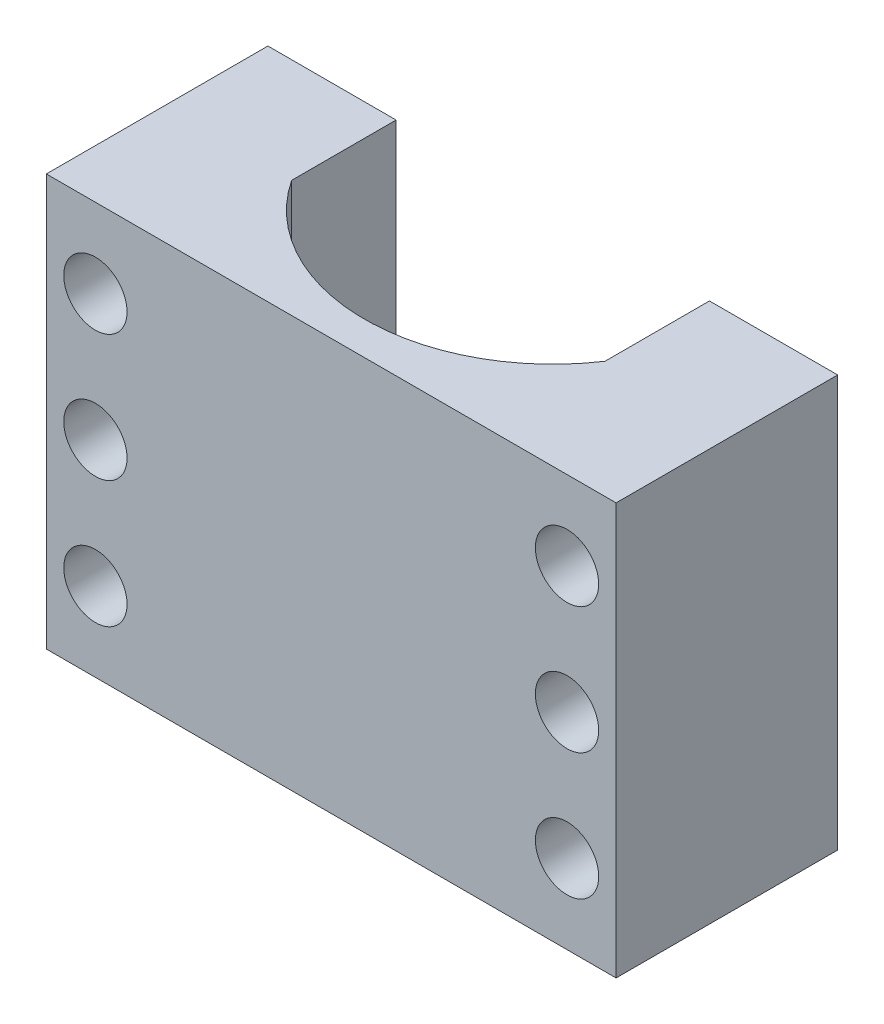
ISO-10303-21;
HEADER;
FILE_DESCRIPTION(('STEP AP214'),'2;1');
FILE_NAME('part.step','',(''),(''),'','','');
FILE_SCHEMA(('AUTOMOTIVE_DESIGN { 1 0 10303 214 1 1 1 1 }'));
ENDSEC;
DATA;
#1=APPLICATION_CONTEXT('core data for automotive mechanical design processes');
#2=APPLICATION_PROTOCOL_DEFINITION('international standard','automotive_design',2000,#1);
#3=PRODUCT_CONTEXT('',#1,'mechanical');
#4=PRODUCT('Part','Part','',(#3));
#5=PRODUCT_RELATED_PRODUCT_CATEGORY('part','',(#4));
#6=PRODUCT_DEFINITION_FORMATION('','',#4);
#7=PRODUCT_DEFINITION_CONTEXT('part definition',#1,'design');
#8=PRODUCT_DEFINITION('design','',#6,#7);
#9=PRODUCT_DEFINITION_SHAPE('','',#8);
#10=(LENGTH_UNIT() NAMED_UNIT(*) SI_UNIT(.MILLI.,.METRE.));
#11=(NAMED_UNIT(*) PLANE_ANGLE_UNIT() SI_UNIT($,.RADIAN.));
#12=(NAMED_UNIT(*) SI_UNIT($,.STERADIAN.) SOLID_ANGLE_UNIT());
#13=UNCERTAINTY_MEASURE_WITH_UNIT(LENGTH_MEASURE(1.E-05),#10,'distance_accuracy_value','');
#14=(GEOMETRIC_REPRESENTATION_CONTEXT(3) GLOBAL_UNCERTAINTY_ASSIGNED_CONTEXT((#13)) GLOBAL_UNIT_ASSIGNED_CONTEXT((#10,
#11,#12)) REPRESENTATION_CONTEXT('',''));
#15=CARTESIAN_POINT('',(0.,0.,0.));
#16=DIRECTION('',(0.,0.,1.));
#17=DIRECTION('',(1.,0.,0.));
#18=AXIS2_PLACEMENT_3D('',#15,#16,#17);
#19=CARTESIAN_POINT('',(0.,-6.5,14.));
#20=DIRECTION('',(0.,1.,0.));
#21=DIRECTION('',(0.,0.,1.));
#22=AXIS2_PLACEMENT_3D('',#19,#20,#21);
#23=PLANE('',#22);
#24=DIRECTION('',(0.,0.,-1.));
#25=VECTOR('',#24,1.);
#26=CARTESIAN_POINT('',(-9.,-6.5,14.));
#27=LINE('',#26,#25);
#28=CARTESIAN_POINT('',(-9.,-6.5,14.));
#29=VERTEX_POINT('',#28);
#30=CARTESIAN_POINT('',(-9.,-6.5,7.));
#31=VERTEX_POINT('',#30);
#32=EDGE_CURVE('E131',#29,#31,#27,.T.);
#33=ORIENTED_EDGE('',*,*,#32,.T.);
#34=DIRECTION('',(-1.,0.,0.));
#35=VECTOR('',#34,1.);
#36=CARTESIAN_POINT('',(9.,-6.5,7.));
#37=LINE('',#36,#35);
#38=CARTESIAN_POINT('',(-4.95,-6.5,7.));
#39=VERTEX_POINT('',#38);
#40=EDGE_CURVE('E107',#39,#31,#37,.T.);
#41=ORIENTED_EDGE('',*,*,#40,.F.);
#42=DIRECTION('',(0.,0.,-1.));
#43=VECTOR('',#42,1.);
#44=CARTESIAN_POINT('',(-4.95,-6.5,0.));
#45=LINE('',#44,#43);
#46=CARTESIAN_POINT('',(-4.95,-6.5,10.3015148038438));
#47=VERTEX_POINT('',#46);
#48=EDGE_CURVE('E186',#47,#39,#45,.T.);
#49=ORIENTED_EDGE('',*,*,#48,.F.);
#50=CARTESIAN_POINT('',(0.,-6.5,7.));
#51=DIRECTION('',(0.,1.,0.));
#52=DIRECTION('',(0.,0.,1.));
#53=AXIS2_PLACEMENT_3D('',#50,#51,#52);
#54=CIRCLE('',#53,5.95);
#55=CARTESIAN_POINT('',(4.95,-6.5,10.3015148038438));
#56=VERTEX_POINT('',#55);
#57=EDGE_CURVE('E190',#47,#56,#54,.T.);
#58=ORIENTED_EDGE('',*,*,#57,.T.);
#59=DIRECTION('',(0.,0.,-1.));
#60=VECTOR('',#59,1.);
#61=CARTESIAN_POINT('',(4.95,-6.5,0.));
#62=LINE('',#61,#60);
#63=CARTESIAN_POINT('',(4.95,-6.5,7.));
#64=VERTEX_POINT('',#63);
#65=EDGE_CURVE('E153',#56,#64,#62,.T.);
#66=ORIENTED_EDGE('',*,*,#65,.T.);
#67=CARTESIAN_POINT('',(9.,-6.5,7.));
#68=VERTEX_POINT('',#67);
#69=EDGE_CURVE('E64',#68,#64,#37,.T.);
#70=ORIENTED_EDGE('',*,*,#69,.F.);
#71=DIRECTION('',(0.,0.,-1.));
#72=VECTOR('',#71,1.);
#73=CARTESIAN_POINT('',(9.,-6.5,14.));
#74=LINE('',#73,#72);
#75=CARTESIAN_POINT('',(9.,-6.5,14.));
#76=VERTEX_POINT('',#75);
#77=EDGE_CURVE('E49',#76,#68,#74,.T.);
#78=ORIENTED_EDGE('',*,*,#77,.F.);
#79=DIRECTION('',(1.,0.,0.));
#80=VECTOR('',#79,1.);
#81=CARTESIAN_POINT('',(0.,-6.5,14.));
#82=LINE('',#81,#80);
#83=EDGE_CURVE('E150',#29,#76,#82,.T.);
#84=ORIENTED_EDGE('',*,*,#83,.F.);
#85=EDGE_LOOP('',(#33,#41,#49,#58,#66,#70,#78,#84));
#86=FACE_BOUND('',#85,.T.);
#87=ADVANCED_FACE('F41',(#86),#23,.F.);
#88=CARTESIAN_POINT('',(0.,6.5,14.));
#89=DIRECTION('',(0.,1.,0.));
#90=DIRECTION('',(0.,0.,1.));
#91=AXIS2_PLACEMENT_3D('',#88,#89,#90);
#92=PLANE('',#91);
#93=DIRECTION('',(1.,0.,0.));
#94=VECTOR('',#93,1.);
#95=CARTESIAN_POINT('',(9.,6.5,7.));
#96=LINE('',#95,#94);
#97=CARTESIAN_POINT('',(-9.,6.5,7.));
#98=VERTEX_POINT('',#97);
#99=CARTESIAN_POINT('',(-4.95,6.5,7.));
#100=VERTEX_POINT('',#99);
#101=EDGE_CURVE('E56',#98,#100,#96,.T.);
#102=ORIENTED_EDGE('',*,*,#101,.F.);
#103=DIRECTION('',(0.,0.,-1.));
#104=VECTOR('',#103,1.);
#105=CARTESIAN_POINT('',(-9.,6.5,14.));
#106=LINE('',#105,#104);
#107=CARTESIAN_POINT('',(-9.,6.5,14.));
#108=VERTEX_POINT('',#107);
#109=EDGE_CURVE('E118',#108,#98,#106,.T.);
#110=ORIENTED_EDGE('',*,*,#109,.F.);
#111=DIRECTION('',(1.,0.,0.));
#112=VECTOR('',#111,1.);
#113=CARTESIAN_POINT('',(0.,6.5,14.));
#114=LINE('',#113,#112);
#115=CARTESIAN_POINT('',(9.,6.5,14.));
#116=VERTEX_POINT('',#115);
#117=EDGE_CURVE('E240',#108,#116,#114,.T.);
#118=ORIENTED_EDGE('',*,*,#117,.T.);
#119=DIRECTION('',(0.,0.,-1.));
#120=VECTOR('',#119,1.);
#121=CARTESIAN_POINT('',(9.,6.5,14.));
#122=LINE('',#121,#120);
#123=CARTESIAN_POINT('',(9.,6.5,7.));
#124=VERTEX_POINT('',#123);
#125=EDGE_CURVE('E130',#116,#124,#122,.T.);
#126=ORIENTED_EDGE('',*,*,#125,.T.);
#127=CARTESIAN_POINT('',(4.95,6.5,7.));
#128=VERTEX_POINT('',#127);
#129=EDGE_CURVE('E112',#128,#124,#96,.T.);
#130=ORIENTED_EDGE('',*,*,#129,.F.);
#131=DIRECTION('',(0.,0.,-1.));
#132=VECTOR('',#131,1.);
#133=CARTESIAN_POINT('',(4.95,6.5,0.));
#134=LINE('',#133,#132);
#135=CARTESIAN_POINT('',(4.95,6.5,10.3015148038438));
#136=VERTEX_POINT('',#135);
#137=EDGE_CURVE('E191',#136,#128,#134,.T.);
#138=ORIENTED_EDGE('',*,*,#137,.F.);
#139=CARTESIAN_POINT('',(0.,6.5,7.));
#140=DIRECTION('',(0.,1.,0.));
#141=DIRECTION('',(0.,0.,1.));
#142=AXIS2_PLACEMENT_3D('',#139,#140,#141);
#143=CIRCLE('',#142,5.95);
#144=CARTESIAN_POINT('',(-4.95,6.5,10.3015148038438));
#145=VERTEX_POINT('',#144);
#146=EDGE_CURVE('E199',#145,#136,#143,.T.);
#147=ORIENTED_EDGE('',*,*,#146,.F.);
#148=DIRECTION('',(0.,0.,-1.));
#149=VECTOR('',#148,1.);
#150=CARTESIAN_POINT('',(-4.95,6.5,0.));
#151=LINE('',#150,#149);
#152=EDGE_CURVE('E121',#145,#100,#151,.T.);
#153=ORIENTED_EDGE('',*,*,#152,.T.);
#154=EDGE_LOOP('',(#102,#110,#118,#126,#130,#138,#147,#153));
#155=FACE_BOUND('',#154,.T.);
#156=ADVANCED_FACE('F116',(#155),#92,.T.);
#157=CARTESIAN_POINT('',(9.,0.,14.));
#158=DIRECTION('',(-1.,0.,0.));
#159=DIRECTION('',(0.,0.,1.));
#160=AXIS2_PLACEMENT_3D('',#157,#158,#159);
#161=PLANE('',#160);
#162=ORIENTED_EDGE('',*,*,#77,.T.);
#163=DIRECTION('',(0.,-1.,0.));
#164=VECTOR('',#163,1.);
#165=CARTESIAN_POINT('',(9.,-6.5,7.));
#166=LINE('',#165,#164);
#167=EDGE_CURVE('E123',#124,#68,#166,.T.);
#168=ORIENTED_EDGE('',*,*,#167,.F.);
#169=ORIENTED_EDGE('',*,*,#125,.F.);
#170=DIRECTION('',(0.,1.,0.));
#171=VECTOR('',#170,1.);
#172=CARTESIAN_POINT('',(9.,0.,14.));
#173=LINE('',#172,#171);
#174=EDGE_CURVE('E146',#76,#116,#173,.T.);
#175=ORIENTED_EDGE('',*,*,#174,.F.);
#176=EDGE_LOOP('',(#162,#168,#169,#175));
#177=FACE_BOUND('',#176,.T.);
#178=ADVANCED_FACE('F144',(#177),#161,.F.);
#179=CARTESIAN_POINT('',(-9.,0.,14.));
#180=DIRECTION('',(-1.,0.,0.));
#181=DIRECTION('',(0.,0.,1.));
#182=AXIS2_PLACEMENT_3D('',#179,#180,#181);
#183=PLANE('',#182);
#184=DIRECTION('',(0.,1.,0.));
#185=VECTOR('',#184,1.);
#186=CARTESIAN_POINT('',(-9.,-6.5,7.));
#187=LINE('',#186,#185);
#188=EDGE_CURVE('E103',#31,#98,#187,.T.);
#189=ORIENTED_EDGE('',*,*,#188,.F.);
#190=ORIENTED_EDGE('',*,*,#32,.F.);
#191=DIRECTION('',(0.,1.,0.));
#192=VECTOR('',#191,1.);
#193=CARTESIAN_POINT('',(-9.,0.,14.));
#194=LINE('',#193,#192);
#195=EDGE_CURVE('E128',#29,#108,#194,.T.);
#196=ORIENTED_EDGE('',*,*,#195,.T.);
#197=ORIENTED_EDGE('',*,*,#109,.T.);
#198=EDGE_LOOP('',(#189,#190,#196,#197));
#199=FACE_BOUND('',#198,.T.);
#200=ADVANCED_FACE('F126',(#199),#183,.T.);
#201=CARTESIAN_POINT('',(0.,0.,14.));
#202=DIRECTION('',(0.,0.,1.));
#203=DIRECTION('',(1.,0.,0.));
#204=AXIS2_PLACEMENT_3D('',#201,#202,#203);
#205=PLANE('',#204);
#206=CARTESIAN_POINT('',(-7.45,-4.,14.));
#207=DIRECTION('',(0.,0.,1.));
#208=DIRECTION('',(-1.,0.,0.));
#209=AXIS2_PLACEMENT_3D('',#206,#207,#208);
#210=CIRCLE('',#209,1.);
#211=CARTESIAN_POINT('',(-8.45,-4.,14.));
#212=VERTEX_POINT('',#211);
#213=EDGE_CURVE('E217',#212,#212,#210,.T.);
#214=ORIENTED_EDGE('',*,*,#213,.F.);
#215=EDGE_LOOP('',(#214));
#216=FACE_BOUND('',#215,.T.);
#217=CARTESIAN_POINT('',(7.45,-4.,14.));
#218=DIRECTION('',(0.,0.,1.));
#219=DIRECTION('',(1.,0.,0.));
#220=AXIS2_PLACEMENT_3D('',#217,#218,#219);
#221=CIRCLE('',#220,1.);
#222=CARTESIAN_POINT('',(8.45,-4.,14.));
#223=VERTEX_POINT('',#222);
#224=EDGE_CURVE('E222',#223,#223,#221,.T.);
#225=ORIENTED_EDGE('',*,*,#224,.F.);
#226=EDGE_LOOP('',(#225));
#227=FACE_BOUND('',#226,.T.);
#228=CARTESIAN_POINT('',(7.45,4.,14.));
#229=DIRECTION('',(0.,0.,1.));
#230=DIRECTION('',(-1.,0.,0.));
#231=AXIS2_PLACEMENT_3D('',#228,#229,#230);
#232=CIRCLE('',#231,1.);
#233=CARTESIAN_POINT('',(6.45,4.,14.));
#234=VERTEX_POINT('',#233);
#235=EDGE_CURVE('E226',#234,#234,#232,.T.);
#236=ORIENTED_EDGE('',*,*,#235,.F.);
#237=EDGE_LOOP('',(#236));
#238=FACE_BOUND('',#237,.T.);
#239=CARTESIAN_POINT('',(-7.45,0.,14.));
#240=DIRECTION('',(0.,0.,1.));
#241=DIRECTION('',(1.,0.,0.));
#242=AXIS2_PLACEMENT_3D('',#239,#240,#241);
#243=CIRCLE('',#242,1.);
#244=CARTESIAN_POINT('',(-6.45,0.,14.));
#245=VERTEX_POINT('',#244);
#246=EDGE_CURVE('E216',#245,#245,#243,.T.);
#247=ORIENTED_EDGE('',*,*,#246,.F.);
#248=EDGE_LOOP('',(#247));
#249=FACE_BOUND('',#248,.T.);
#250=CARTESIAN_POINT('',(7.45,0.,14.));
#251=DIRECTION('',(0.,0.,1.));
#252=DIRECTION('',(-1.,0.,0.));
#253=AXIS2_PLACEMENT_3D('',#250,#251,#252);
#254=CIRCLE('',#253,1.);
#255=CARTESIAN_POINT('',(6.45,0.,14.));
#256=VERTEX_POINT('',#255);
#257=EDGE_CURVE('E209',#256,#256,#254,.T.);
#258=ORIENTED_EDGE('',*,*,#257,.F.);
#259=EDGE_LOOP('',(#258));
#260=FACE_BOUND('',#259,.T.);
#261=CARTESIAN_POINT('',(-7.45,4.,14.));
#262=DIRECTION('',(0.,0.,1.));
#263=DIRECTION('',(1.,0.,0.));
#264=AXIS2_PLACEMENT_3D('',#261,#262,#263);
#265=CIRCLE('',#264,1.);
#266=CARTESIAN_POINT('',(-6.45,4.,14.));
#267=VERTEX_POINT('',#266);
#268=EDGE_CURVE('E221',#267,#267,#265,.T.);
#269=ORIENTED_EDGE('',*,*,#268,.F.);
#270=EDGE_LOOP('',(#269));
#271=FACE_BOUND('',#270,.T.);
#272=ORIENTED_EDGE('',*,*,#83,.T.);
#273=ORIENTED_EDGE('',*,*,#174,.T.);
#274=ORIENTED_EDGE('',*,*,#117,.F.);
#275=ORIENTED_EDGE('',*,*,#195,.F.);
#276=EDGE_LOOP('',(#272,#273,#274,#275));
#277=FACE_BOUND('',#276,.T.);
#278=ADVANCED_FACE('F245',(#216,#227,#238,#249,#260,#271,#277),#205,.T.);
#279=CARTESIAN_POINT('',(-7.45,4.,0.));
#280=DIRECTION('',(0.,0.,1.));
#281=DIRECTION('',(1.,0.,0.));
#282=AXIS2_PLACEMENT_3D('',#279,#280,#281);
#283=CYLINDRICAL_SURFACE('',#282,1.);
#284=CARTESIAN_POINT('',(-7.45,4.,7.));
#285=DIRECTION('',(0.,0.,1.));
#286=DIRECTION('',(1.,0.,0.));
#287=AXIS2_PLACEMENT_3D('',#284,#285,#286);
#288=CIRCLE('',#287,1.);
#289=CARTESIAN_POINT('',(-6.45,4.,7.));
#290=VERTEX_POINT('',#289);
#291=EDGE_CURVE('E182',#290,#290,#288,.F.);
#292=ORIENTED_EDGE('',*,*,#291,.T.);
#293=EDGE_LOOP('',(#292));
#294=FACE_BOUND('',#293,.T.);
#295=ORIENTED_EDGE('',*,*,#268,.T.);
#296=EDGE_LOOP('',(#295));
#297=FACE_BOUND('',#296,.T.);
#298=ADVANCED_FACE('F247',(#294,#297),#283,.F.);
#299=CARTESIAN_POINT('',(7.45,0.,0.));
#300=DIRECTION('',(0.,0.,1.));
#301=DIRECTION('',(1.,0.,0.));
#302=AXIS2_PLACEMENT_3D('',#299,#300,#301);
#303=CYLINDRICAL_SURFACE('',#302,1.);
#304=CARTESIAN_POINT('',(7.45,0.,7.));
#305=DIRECTION('',(0.,0.,1.));
#306=DIRECTION('',(1.,0.,0.));
#307=AXIS2_PLACEMENT_3D('',#304,#305,#306);
#308=CIRCLE('',#307,1.);
#309=CARTESIAN_POINT('',(8.45,0.,7.));
#310=VERTEX_POINT('',#309);
#311=EDGE_CURVE('E178',#310,#310,#308,.F.);
#312=ORIENTED_EDGE('',*,*,#311,.T.);
#313=EDGE_LOOP('',(#312));
#314=FACE_BOUND('',#313,.T.);
#315=ORIENTED_EDGE('',*,*,#257,.T.);
#316=EDGE_LOOP('',(#315));
#317=FACE_BOUND('',#316,.T.);
#318=ADVANCED_FACE('F254',(#314,#317),#303,.F.);
#319=CARTESIAN_POINT('',(-7.45,0.,0.));
#320=DIRECTION('',(0.,0.,1.));
#321=DIRECTION('',(1.,0.,0.));
#322=AXIS2_PLACEMENT_3D('',#319,#320,#321);
#323=CYLINDRICAL_SURFACE('',#322,1.);
#324=CARTESIAN_POINT('',(-7.45,0.,7.));
#325=DIRECTION('',(0.,0.,1.));
#326=DIRECTION('',(1.,0.,0.));
#327=AXIS2_PLACEMENT_3D('',#324,#325,#326);
#328=CIRCLE('',#327,1.);
#329=CARTESIAN_POINT('',(-6.45,0.,7.));
#330=VERTEX_POINT('',#329);
#331=EDGE_CURVE('E174',#330,#330,#328,.F.);
#332=ORIENTED_EDGE('',*,*,#331,.T.);
#333=EDGE_LOOP('',(#332));
#334=FACE_BOUND('',#333,.T.);
#335=ORIENTED_EDGE('',*,*,#246,.T.);
#336=EDGE_LOOP('',(#335));
#337=FACE_BOUND('',#336,.T.);
#338=ADVANCED_FACE('F291',(#334,#337),#323,.F.);
#339=CARTESIAN_POINT('',(7.45,4.,0.));
#340=DIRECTION('',(0.,0.,1.));
#341=DIRECTION('',(1.,0.,0.));
#342=AXIS2_PLACEMENT_3D('',#339,#340,#341);
#343=CYLINDRICAL_SURFACE('',#342,1.);
#344=CARTESIAN_POINT('',(7.45,4.,7.));
#345=DIRECTION('',(0.,0.,1.));
#346=DIRECTION('',(1.,0.,0.));
#347=AXIS2_PLACEMENT_3D('',#344,#345,#346);
#348=CIRCLE('',#347,1.);
#349=CARTESIAN_POINT('',(8.45,4.,7.));
#350=VERTEX_POINT('',#349);
#351=EDGE_CURVE('E170',#350,#350,#348,.F.);
#352=ORIENTED_EDGE('',*,*,#351,.T.);
#353=EDGE_LOOP('',(#352));
#354=FACE_BOUND('',#353,.T.);
#355=ORIENTED_EDGE('',*,*,#235,.T.);
#356=EDGE_LOOP('',(#355));
#357=FACE_BOUND('',#356,.T.);
#358=ADVANCED_FACE('F301',(#354,#357),#343,.F.);
#359=CARTESIAN_POINT('',(7.45,-4.,0.));
#360=DIRECTION('',(0.,0.,1.));
#361=DIRECTION('',(1.,0.,0.));
#362=AXIS2_PLACEMENT_3D('',#359,#360,#361);
#363=CYLINDRICAL_SURFACE('',#362,1.);
#364=CARTESIAN_POINT('',(7.45,-4.,7.));
#365=DIRECTION('',(0.,0.,1.));
#366=DIRECTION('',(1.,0.,0.));
#367=AXIS2_PLACEMENT_3D('',#364,#365,#366);
#368=CIRCLE('',#367,1.);
#369=CARTESIAN_POINT('',(8.45,-4.,7.));
#370=VERTEX_POINT('',#369);
#371=EDGE_CURVE('E166',#370,#370,#368,.F.);
#372=ORIENTED_EDGE('',*,*,#371,.T.);
#373=EDGE_LOOP('',(#372));
#374=FACE_BOUND('',#373,.T.);
#375=ORIENTED_EDGE('',*,*,#224,.T.);
#376=EDGE_LOOP('',(#375));
#377=FACE_BOUND('',#376,.T.);
#378=ADVANCED_FACE('F311',(#374,#377),#363,.F.);
#379=CARTESIAN_POINT('',(-7.45,-4.,0.));
#380=DIRECTION('',(0.,0.,1.));
#381=DIRECTION('',(1.,0.,0.));
#382=AXIS2_PLACEMENT_3D('',#379,#380,#381);
#383=CYLINDRICAL_SURFACE('',#382,1.);
#384=CARTESIAN_POINT('',(-7.45,-4.,7.));
#385=DIRECTION('',(0.,0.,1.));
#386=DIRECTION('',(1.,0.,0.));
#387=AXIS2_PLACEMENT_3D('',#384,#385,#386);
#388=CIRCLE('',#387,1.);
#389=CARTESIAN_POINT('',(-6.45,-4.,7.));
#390=VERTEX_POINT('',#389);
#391=EDGE_CURVE('E159',#390,#390,#388,.F.);
#392=ORIENTED_EDGE('',*,*,#391,.T.);
#393=EDGE_LOOP('',(#392));
#394=FACE_BOUND('',#393,.T.);
#395=ORIENTED_EDGE('',*,*,#213,.T.);
#396=EDGE_LOOP('',(#395));
#397=FACE_BOUND('',#396,.T.);
#398=ADVANCED_FACE('F321',(#394,#397),#383,.F.);
#399=CARTESIAN_POINT('',(-4.95,-6.5,0.));
#400=DIRECTION('',(1.,0.,0.));
#401=DIRECTION('',(0.,0.,-1.));
#402=AXIS2_PLACEMENT_3D('',#399,#400,#401);
#403=PLANE('',#402);
#404=DIRECTION('',(0.,-1.,0.));
#405=VECTOR('',#404,1.);
#406=CARTESIAN_POINT('',(-4.95,-6.5,7.));
#407=LINE('',#406,#405);
#408=EDGE_CURVE('E155',#100,#39,#407,.T.);
#409=ORIENTED_EDGE('',*,*,#408,.F.);
#410=ORIENTED_EDGE('',*,*,#152,.F.);
#411=DIRECTION('',(0.,1.,0.));
#412=VECTOR('',#411,1.);
#413=CARTESIAN_POINT('',(-4.95,-6.5,10.3015148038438));
#414=LINE('',#413,#412);
#415=EDGE_CURVE('E196',#47,#145,#414,.T.);
#416=ORIENTED_EDGE('',*,*,#415,.F.);
#417=ORIENTED_EDGE('',*,*,#48,.T.);
#418=EDGE_LOOP('',(#409,#410,#416,#417));
#419=FACE_BOUND('',#418,.T.);
#420=ADVANCED_FACE('F331',(#419),#403,.T.);
#421=CARTESIAN_POINT('',(4.95,-6.5,0.));
#422=DIRECTION('',(1.,0.,0.));
#423=DIRECTION('',(0.,0.,-1.));
#424=AXIS2_PLACEMENT_3D('',#421,#422,#423);
#425=PLANE('',#424);
#426=ORIENTED_EDGE('',*,*,#137,.T.);
#427=DIRECTION('',(0.,-1.,0.));
#428=VECTOR('',#427,1.);
#429=CARTESIAN_POINT('',(4.95,-6.5,7.));
#430=LINE('',#429,#428);
#431=EDGE_CURVE('E11',#128,#64,#430,.T.);
#432=ORIENTED_EDGE('',*,*,#431,.T.);
#433=ORIENTED_EDGE('',*,*,#65,.F.);
#434=DIRECTION('',(0.,1.,0.));
#435=VECTOR('',#434,1.);
#436=CARTESIAN_POINT('',(4.95,-6.5,10.3015148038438));
#437=LINE('',#436,#435);
#438=EDGE_CURVE('E206',#56,#136,#437,.T.);
#439=ORIENTED_EDGE('',*,*,#438,.T.);
#440=EDGE_LOOP('',(#426,#432,#433,#439));
#441=FACE_BOUND('',#440,.T.);
#442=ADVANCED_FACE('F342',(#441),#425,.F.);
#443=CARTESIAN_POINT('',(0.,-6.5,7.));
#444=DIRECTION('',(0.,1.,0.));
#445=DIRECTION('',(0.,0.,1.));
#446=AXIS2_PLACEMENT_3D('',#443,#444,#445);
#447=CYLINDRICAL_SURFACE('',#446,5.95);
#448=ORIENTED_EDGE('',*,*,#146,.T.);
#449=ORIENTED_EDGE('',*,*,#438,.F.);
#450=ORIENTED_EDGE('',*,*,#57,.F.);
#451=ORIENTED_EDGE('',*,*,#415,.T.);
#452=EDGE_LOOP('',(#448,#449,#450,#451));
#453=FACE_BOUND('',#452,.T.);
#454=ADVANCED_FACE('F353',(#453),#447,.F.);
#455=CARTESIAN_POINT('',(0.,0.,7.));
#456=DIRECTION('',(0.,0.,1.));
#457=DIRECTION('',(1.,0.,0.));
#458=AXIS2_PLACEMENT_3D('',#455,#456,#457);
#459=PLANE('',#458);
#460=ORIENTED_EDGE('',*,*,#351,.F.);
#461=EDGE_LOOP('',(#460));
#462=FACE_BOUND('',#461,.T.);
#463=ORIENTED_EDGE('',*,*,#129,.T.);
#464=ORIENTED_EDGE('',*,*,#167,.T.);
#465=ORIENTED_EDGE('',*,*,#69,.T.);
#466=ORIENTED_EDGE('',*,*,#431,.F.);
#467=EDGE_LOOP('',(#463,#464,#465,#466));
#468=FACE_BOUND('',#467,.T.);
#469=ORIENTED_EDGE('',*,*,#371,.F.);
#470=EDGE_LOOP('',(#469));
#471=FACE_BOUND('',#470,.T.);
#472=ORIENTED_EDGE('',*,*,#311,.F.);
#473=EDGE_LOOP('',(#472));
#474=FACE_BOUND('',#473,.T.);
#475=ADVANCED_FACE('F361',(#462,#468,#471,#474),#459,.F.);
#476=ORIENTED_EDGE('',*,*,#331,.F.);
#477=EDGE_LOOP('',(#476));
#478=FACE_BOUND('',#477,.T.);
#479=ORIENTED_EDGE('',*,*,#408,.T.);
#480=ORIENTED_EDGE('',*,*,#40,.T.);
#481=ORIENTED_EDGE('',*,*,#188,.T.);
#482=ORIENTED_EDGE('',*,*,#101,.T.);
#483=EDGE_LOOP('',(#479,#480,#481,#482));
#484=FACE_BOUND('',#483,.T.);
#485=ORIENTED_EDGE('',*,*,#391,.F.);
#486=EDGE_LOOP('',(#485));
#487=FACE_BOUND('',#486,.T.);
#488=ORIENTED_EDGE('',*,*,#291,.F.);
#489=EDGE_LOOP('',(#488));
#490=FACE_BOUND('',#489,.T.);
#491=ADVANCED_FACE('F104',(#478,#484,#487,#490),#459,.F.);
#492=CLOSED_SHELL('',(#87,#156,#178,#200,#278,#298,#318,#338,#358,#378,#398,#420,#442,#454,#475,#491));
#493=MANIFOLD_SOLID_BREP('B2',#492);
#494=ADVANCED_BREP_SHAPE_REPRESENTATION('',(#18,#493),#14);
#495=SHAPE_DEFINITION_REPRESENTATION(#9,#494);
ENDSEC;
END-ISO-10303-21;
